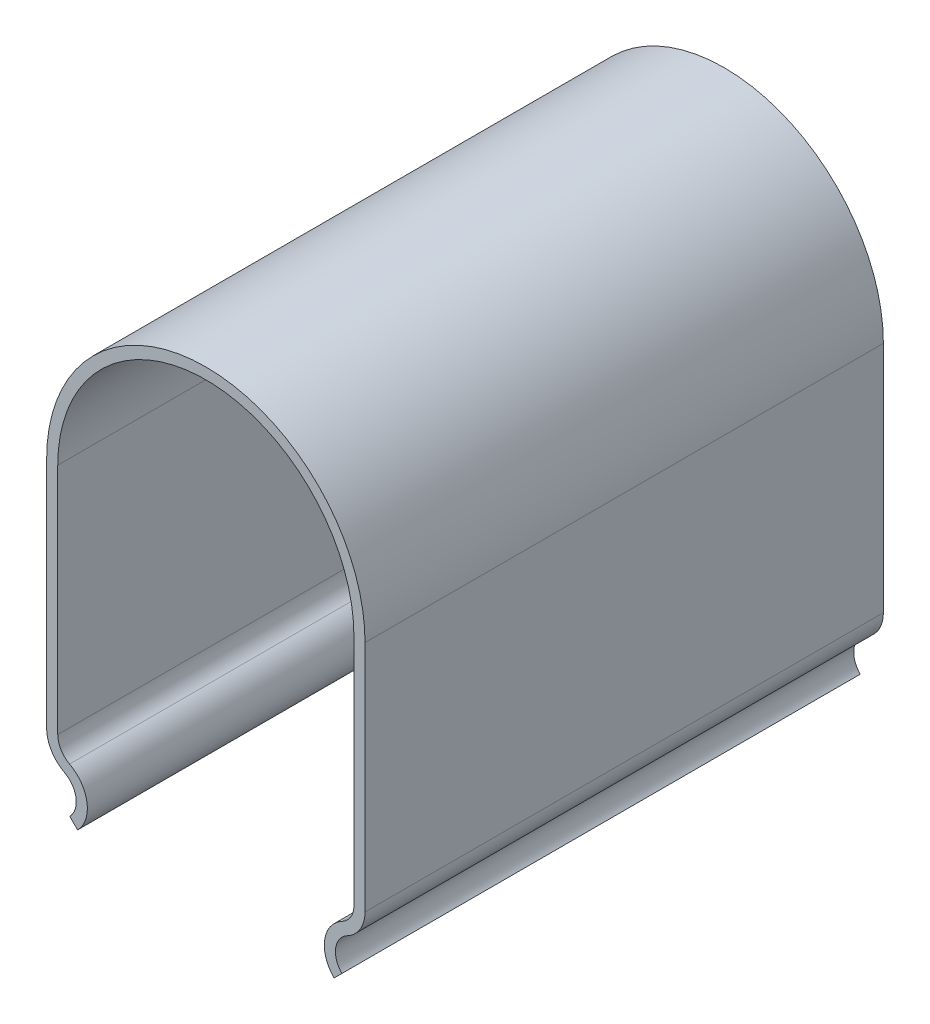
ISO-10303-21;
HEADER;
FILE_DESCRIPTION(('STEP AP214'),'2;1');
FILE_NAME('part.step','',(''),(''),'','','');
FILE_SCHEMA(('AUTOMOTIVE_DESIGN { 1 0 10303 214 1 1 1 1 }'));
ENDSEC;
DATA;
#1=APPLICATION_CONTEXT('core data for automotive mechanical design processes');
#2=APPLICATION_PROTOCOL_DEFINITION('international standard','automotive_design',2000,#1);
#3=PRODUCT_CONTEXT('',#1,'mechanical');
#4=PRODUCT('Part','Part','',(#3));
#5=PRODUCT_RELATED_PRODUCT_CATEGORY('part','',(#4));
#6=PRODUCT_DEFINITION_FORMATION('','',#4);
#7=PRODUCT_DEFINITION_CONTEXT('part definition',#1,'design');
#8=PRODUCT_DEFINITION('design','',#6,#7);
#9=PRODUCT_DEFINITION_SHAPE('','',#8);
#10=(LENGTH_UNIT() NAMED_UNIT(*) SI_UNIT(.MILLI.,.METRE.));
#11=(NAMED_UNIT(*) PLANE_ANGLE_UNIT() SI_UNIT($,.RADIAN.));
#12=(NAMED_UNIT(*) SI_UNIT($,.STERADIAN.) SOLID_ANGLE_UNIT());
#13=UNCERTAINTY_MEASURE_WITH_UNIT(LENGTH_MEASURE(1.E-05),#10,'distance_accuracy_value','');
#14=(GEOMETRIC_REPRESENTATION_CONTEXT(3) GLOBAL_UNCERTAINTY_ASSIGNED_CONTEXT((#13)) GLOBAL_UNIT_ASSIGNED_CONTEXT((#10,
#11,#12)) REPRESENTATION_CONTEXT('',''));
#15=CARTESIAN_POINT('',(0.,0.,0.));
#16=DIRECTION('',(0.,0.,1.));
#17=DIRECTION('',(1.,0.,0.));
#18=AXIS2_PLACEMENT_3D('',#15,#16,#17);
#19=CARTESIAN_POINT('',(17.,-31.5,70.));
#20=DIRECTION('',(0.,0.,-1.));
#21=DIRECTION('',(-1.,0.,0.));
#22=AXIS2_PLACEMENT_3D('',#19,#20,#21);
#23=CYLINDRICAL_SURFACE('',#22,3.);
#24=CARTESIAN_POINT('',(17.,-31.5,0.));
#25=DIRECTION('',(0.,0.,-1.));
#26=DIRECTION('',(1.,0.,0.));
#27=AXIS2_PLACEMENT_3D('',#24,#25,#26);
#28=CIRCLE('',#27,3.);
#29=CARTESIAN_POINT('',(20.,-31.5,0.));
#30=VERTEX_POINT('',#29);
#31=CARTESIAN_POINT('',(18.4,-34.1532998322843,0.));
#32=VERTEX_POINT('',#31);
#33=EDGE_CURVE('E466',#30,#32,#28,.T.);
#34=ORIENTED_EDGE('',*,*,#33,.T.);
#35=DIRECTION('',(0.,0.,-1.));
#36=VECTOR('',#35,1.);
#37=CARTESIAN_POINT('',(18.4,-34.1532998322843,70.));
#38=LINE('',#37,#36);
#39=CARTESIAN_POINT('',(18.4,-34.1532998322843,70.));
#40=VERTEX_POINT('',#39);
#41=EDGE_CURVE('E11',#40,#32,#38,.T.);
#42=ORIENTED_EDGE('',*,*,#41,.F.);
#43=CARTESIAN_POINT('',(17.,-31.5,70.));
#44=DIRECTION('',(0.,0.,-1.));
#45=DIRECTION('',(1.,0.,0.));
#46=AXIS2_PLACEMENT_3D('',#43,#44,#45);
#47=CIRCLE('',#46,3.);
#48=CARTESIAN_POINT('',(20.,-31.5,70.));
#49=VERTEX_POINT('',#48);
#50=EDGE_CURVE('E509',#49,#40,#47,.T.);
#51=ORIENTED_EDGE('',*,*,#50,.F.);
#52=DIRECTION('',(0.,0.,-1.));
#53=VECTOR('',#52,1.);
#54=CARTESIAN_POINT('',(20.,-31.5,70.));
#55=LINE('',#54,#53);
#56=EDGE_CURVE('E479',#49,#30,#55,.T.);
#57=ORIENTED_EDGE('',*,*,#56,.T.);
#58=EDGE_LOOP('',(#34,#42,#51,#57));
#59=FACE_BOUND('',#58,.T.);
#60=ADVANCED_FACE('F350',(#59),#23,.F.);
#61=CARTESIAN_POINT('',(20.5,-38.1332495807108,70.));
#62=DIRECTION('',(0.,0.,-1.));
#63=DIRECTION('',(-1.,0.,0.));
#64=AXIS2_PLACEMENT_3D('',#61,#62,#63);
#65=CYLINDRICAL_SURFACE('',#64,4.5);
#66=CARTESIAN_POINT('',(20.5,-38.1332495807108,0.));
#67=DIRECTION('',(0.,0.,1.));
#68=DIRECTION('',(1.,0.,0.));
#69=AXIS2_PLACEMENT_3D('',#66,#67,#68);
#70=CIRCLE('',#69,4.5);
#71=CARTESIAN_POINT('',(17.3180194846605,-41.3152300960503,0.));
#72=VERTEX_POINT('',#71);
#73=EDGE_CURVE('E462',#32,#72,#70,.T.);
#74=ORIENTED_EDGE('',*,*,#73,.T.);
#75=DIRECTION('',(0.,0.,-1.));
#76=VECTOR('',#75,1.);
#77=CARTESIAN_POINT('',(17.3180194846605,-41.3152300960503,70.));
#78=LINE('',#77,#76);
#79=CARTESIAN_POINT('',(17.3180194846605,-41.3152300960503,70.));
#80=VERTEX_POINT('',#79);
#81=EDGE_CURVE('E357',#80,#72,#78,.T.);
#82=ORIENTED_EDGE('',*,*,#81,.F.);
#83=CARTESIAN_POINT('',(20.5,-38.1332495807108,70.));
#84=DIRECTION('',(0.,0.,1.));
#85=DIRECTION('',(1.,0.,0.));
#86=AXIS2_PLACEMENT_3D('',#83,#84,#85);
#87=CIRCLE('',#86,4.5);
#88=EDGE_CURVE('E475',#40,#80,#87,.T.);
#89=ORIENTED_EDGE('',*,*,#88,.F.);
#90=ORIENTED_EDGE('',*,*,#41,.T.);
#91=EDGE_LOOP('',(#74,#82,#89,#90));
#92=FACE_BOUND('',#91,.T.);
#93=ADVANCED_FACE('F474',(#92),#65,.T.);
#94=CARTESIAN_POINT('',(18.3786796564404,-40.2545699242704,70.));
#95=DIRECTION('',(-0.707106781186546,0.707106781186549,0.));
#96=DIRECTION('',(-0.707106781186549,-0.707106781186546,0.));
#97=AXIS2_PLACEMENT_3D('',#94,#95,#96);
#98=PLANE('',#97);
#99=DIRECTION('',(0.707106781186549,0.707106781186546,0.));
#100=VECTOR('',#99,1.);
#101=CARTESIAN_POINT('',(18.3786796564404,-40.2545699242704,0.));
#102=LINE('',#101,#100);
#103=CARTESIAN_POINT('',(18.3786796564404,-40.2545699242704,0.));
#104=VERTEX_POINT('',#103);
#105=EDGE_CURVE('E468',#72,#104,#102,.T.);
#106=ORIENTED_EDGE('',*,*,#105,.T.);
#107=DIRECTION('',(0.,0.,-1.));
#108=VECTOR('',#107,1.);
#109=CARTESIAN_POINT('',(18.3786796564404,-40.2545699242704,70.));
#110=LINE('',#109,#108);
#111=CARTESIAN_POINT('',(18.3786796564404,-40.2545699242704,70.));
#112=VERTEX_POINT('',#111);
#113=EDGE_CURVE('E575',#112,#104,#110,.T.);
#114=ORIENTED_EDGE('',*,*,#113,.F.);
#115=DIRECTION('',(0.707106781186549,0.707106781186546,0.));
#116=VECTOR('',#115,1.);
#117=CARTESIAN_POINT('',(18.3786796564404,-40.2545699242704,70.));
#118=LINE('',#117,#116);
#119=EDGE_CURVE('E512',#80,#112,#118,.T.);
#120=ORIENTED_EDGE('',*,*,#119,.F.);
#121=ORIENTED_EDGE('',*,*,#81,.T.);
#122=EDGE_LOOP('',(#106,#114,#120,#121));
#123=FACE_BOUND('',#122,.T.);
#124=ADVANCED_FACE('F579',(#123),#98,.F.);
#125=CARTESIAN_POINT('',(20.5,-38.1332495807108,70.));
#126=DIRECTION('',(0.,0.,-1.));
#127=DIRECTION('',(-1.,0.,0.));
#128=AXIS2_PLACEMENT_3D('',#125,#126,#127);
#129=CYLINDRICAL_SURFACE('',#128,3.);
#130=CARTESIAN_POINT('',(20.5,-38.1332495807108,0.));
#131=DIRECTION('',(0.,0.,-1.));
#132=DIRECTION('',(1.,0.,0.));
#133=AXIS2_PLACEMENT_3D('',#130,#131,#132);
#134=CIRCLE('',#133,3.);
#135=CARTESIAN_POINT('',(19.1,-35.4799497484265,0.));
#136=VERTEX_POINT('',#135);
#137=EDGE_CURVE('E483',#104,#136,#134,.T.);
#138=ORIENTED_EDGE('',*,*,#137,.T.);
#139=DIRECTION('',(0.,0.,-1.));
#140=VECTOR('',#139,1.);
#141=CARTESIAN_POINT('',(19.1,-35.4799497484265,70.));
#142=LINE('',#141,#140);
#143=CARTESIAN_POINT('',(19.1,-35.4799497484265,70.));
#144=VERTEX_POINT('',#143);
#145=EDGE_CURVE('E572',#144,#136,#142,.T.);
#146=ORIENTED_EDGE('',*,*,#145,.F.);
#147=CARTESIAN_POINT('',(20.5,-38.1332495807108,70.));
#148=DIRECTION('',(0.,0.,-1.));
#149=DIRECTION('',(1.,0.,0.));
#150=AXIS2_PLACEMENT_3D('',#147,#148,#149);
#151=CIRCLE('',#150,3.);
#152=EDGE_CURVE('E514',#112,#144,#151,.T.);
#153=ORIENTED_EDGE('',*,*,#152,.F.);
#154=ORIENTED_EDGE('',*,*,#113,.T.);
#155=EDGE_LOOP('',(#138,#146,#153,#154));
#156=FACE_BOUND('',#155,.T.);
#157=ADVANCED_FACE('F587',(#156),#129,.F.);
#158=CARTESIAN_POINT('',(17.,-31.5,70.));
#159=DIRECTION('',(0.,0.,-1.));
#160=DIRECTION('',(-1.,0.,0.));
#161=AXIS2_PLACEMENT_3D('',#158,#159,#160);
#162=CYLINDRICAL_SURFACE('',#161,4.5);
#163=CARTESIAN_POINT('',(17.,-31.5,0.));
#164=DIRECTION('',(0.,0.,1.));
#165=DIRECTION('',(1.,0.,0.));
#166=AXIS2_PLACEMENT_3D('',#163,#164,#165);
#167=CIRCLE('',#166,4.5);
#168=CARTESIAN_POINT('',(21.5,-31.5,0.));
#169=VERTEX_POINT('',#168);
#170=EDGE_CURVE('E485',#136,#169,#167,.T.);
#171=ORIENTED_EDGE('',*,*,#170,.T.);
#172=DIRECTION('',(0.,0.,-1.));
#173=VECTOR('',#172,1.);
#174=CARTESIAN_POINT('',(21.5,-31.5,70.));
#175=LINE('',#174,#173);
#176=CARTESIAN_POINT('',(21.5,-31.5,70.));
#177=VERTEX_POINT('',#176);
#178=EDGE_CURVE('E569',#177,#169,#175,.T.);
#179=ORIENTED_EDGE('',*,*,#178,.F.);
#180=CARTESIAN_POINT('',(17.,-31.5,70.));
#181=DIRECTION('',(0.,0.,1.));
#182=DIRECTION('',(1.,0.,0.));
#183=AXIS2_PLACEMENT_3D('',#180,#181,#182);
#184=CIRCLE('',#183,4.5);
#185=EDGE_CURVE('E516',#144,#177,#184,.T.);
#186=ORIENTED_EDGE('',*,*,#185,.F.);
#187=ORIENTED_EDGE('',*,*,#145,.T.);
#188=EDGE_LOOP('',(#171,#179,#186,#187));
#189=FACE_BOUND('',#188,.T.);
#190=ADVANCED_FACE('F590',(#189),#162,.T.);
#191=CARTESIAN_POINT('',(21.5,0.,70.));
#192=DIRECTION('',(-1.,0.,0.));
#193=DIRECTION('',(0.,-1.,0.));
#194=AXIS2_PLACEMENT_3D('',#191,#192,#193);
#195=PLANE('',#194);
#196=DIRECTION('',(0.,1.,0.));
#197=VECTOR('',#196,1.);
#198=CARTESIAN_POINT('',(21.5,0.,0.));
#199=LINE('',#198,#197);
#200=CARTESIAN_POINT('',(21.5,0.,0.));
#201=VERTEX_POINT('',#200);
#202=EDGE_CURVE('E487',#169,#201,#199,.T.);
#203=ORIENTED_EDGE('',*,*,#202,.T.);
#204=DIRECTION('',(0.,0.,-1.));
#205=VECTOR('',#204,1.);
#206=CARTESIAN_POINT('',(21.5,0.,70.));
#207=LINE('',#206,#205);
#208=CARTESIAN_POINT('',(21.5,0.,70.));
#209=VERTEX_POINT('',#208);
#210=EDGE_CURVE('E566',#209,#201,#207,.T.);
#211=ORIENTED_EDGE('',*,*,#210,.F.);
#212=DIRECTION('',(0.,1.,0.));
#213=VECTOR('',#212,1.);
#214=CARTESIAN_POINT('',(21.5,0.,70.));
#215=LINE('',#214,#213);
#216=EDGE_CURVE('E518',#177,#209,#215,.T.);
#217=ORIENTED_EDGE('',*,*,#216,.F.);
#218=ORIENTED_EDGE('',*,*,#178,.T.);
#219=EDGE_LOOP('',(#203,#211,#217,#218));
#220=FACE_BOUND('',#219,.T.);
#221=ADVANCED_FACE('F595',(#220),#195,.F.);
#222=CARTESIAN_POINT('',(0.,0.,70.));
#223=DIRECTION('',(0.,0.,-1.));
#224=DIRECTION('',(-1.,0.,0.));
#225=AXIS2_PLACEMENT_3D('',#222,#223,#224);
#226=CYLINDRICAL_SURFACE('',#225,21.5);
#227=CARTESIAN_POINT('',(0.,0.,0.));
#228=DIRECTION('',(0.,0.,1.));
#229=DIRECTION('',(1.,0.,0.));
#230=AXIS2_PLACEMENT_3D('',#227,#228,#229);
#231=CIRCLE('',#230,21.5);
#232=CARTESIAN_POINT('',(-21.5,0.,0.));
#233=VERTEX_POINT('',#232);
#234=EDGE_CURVE('E489',#201,#233,#231,.T.);
#235=ORIENTED_EDGE('',*,*,#234,.T.);
#236=DIRECTION('',(0.,0.,-1.));
#237=VECTOR('',#236,1.);
#238=CARTESIAN_POINT('',(-21.5,0.,70.));
#239=LINE('',#238,#237);
#240=CARTESIAN_POINT('',(-21.5,0.,70.));
#241=VERTEX_POINT('',#240);
#242=EDGE_CURVE('E563',#241,#233,#239,.T.);
#243=ORIENTED_EDGE('',*,*,#242,.F.);
#244=CARTESIAN_POINT('',(0.,0.,70.));
#245=DIRECTION('',(0.,0.,1.));
#246=DIRECTION('',(1.,0.,0.));
#247=AXIS2_PLACEMENT_3D('',#244,#245,#246);
#248=CIRCLE('',#247,21.5);
#249=EDGE_CURVE('E520',#209,#241,#248,.T.);
#250=ORIENTED_EDGE('',*,*,#249,.F.);
#251=ORIENTED_EDGE('',*,*,#210,.T.);
#252=EDGE_LOOP('',(#235,#243,#250,#251));
#253=FACE_BOUND('',#252,.T.);
#254=ADVANCED_FACE('F601',(#253),#226,.T.);
#255=CARTESIAN_POINT('',(-21.5,-31.5,70.));
#256=DIRECTION('',(1.,0.,0.));
#257=DIRECTION('',(0.,0.,-1.));
#258=AXIS2_PLACEMENT_3D('',#255,#256,#257);
#259=PLANE('',#258);
#260=DIRECTION('',(0.,-1.,0.));
#261=VECTOR('',#260,1.);
#262=CARTESIAN_POINT('',(-21.5,-31.5,0.));
#263=LINE('',#262,#261);
#264=CARTESIAN_POINT('',(-21.5,-31.5,0.));
#265=VERTEX_POINT('',#264);
#266=EDGE_CURVE('E491',#233,#265,#263,.T.);
#267=ORIENTED_EDGE('',*,*,#266,.T.);
#268=DIRECTION('',(0.,0.,-1.));
#269=VECTOR('',#268,1.);
#270=CARTESIAN_POINT('',(-21.5,-31.5,70.));
#271=LINE('',#270,#269);
#272=CARTESIAN_POINT('',(-21.5,-31.5,70.));
#273=VERTEX_POINT('',#272);
#274=EDGE_CURVE('E560',#273,#265,#271,.T.);
#275=ORIENTED_EDGE('',*,*,#274,.F.);
#276=DIRECTION('',(0.,-1.,0.));
#277=VECTOR('',#276,1.);
#278=CARTESIAN_POINT('',(-21.5,-31.5,70.));
#279=LINE('',#278,#277);
#280=EDGE_CURVE('E522',#241,#273,#279,.T.);
#281=ORIENTED_EDGE('',*,*,#280,.F.);
#282=ORIENTED_EDGE('',*,*,#242,.T.);
#283=EDGE_LOOP('',(#267,#275,#281,#282));
#284=FACE_BOUND('',#283,.T.);
#285=ADVANCED_FACE('F605',(#284),#259,.F.);
#286=CARTESIAN_POINT('',(-17.,-31.5,70.));
#287=DIRECTION('',(0.,0.,-1.));
#288=DIRECTION('',(-1.,0.,0.));
#289=AXIS2_PLACEMENT_3D('',#286,#287,#288);
#290=CYLINDRICAL_SURFACE('',#289,4.5);
#291=CARTESIAN_POINT('',(-17.,-31.5,0.));
#292=DIRECTION('',(0.,0.,1.));
#293=DIRECTION('',(-1.,0.,0.));
#294=AXIS2_PLACEMENT_3D('',#291,#292,#293);
#295=CIRCLE('',#294,4.5);
#296=CARTESIAN_POINT('',(-19.1,-35.4799497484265,0.));
#297=VERTEX_POINT('',#296);
#298=EDGE_CURVE('E493',#265,#297,#295,.T.);
#299=ORIENTED_EDGE('',*,*,#298,.T.);
#300=DIRECTION('',(0.,0.,-1.));
#301=VECTOR('',#300,1.);
#302=CARTESIAN_POINT('',(-19.1,-35.4799497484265,70.));
#303=LINE('',#302,#301);
#304=CARTESIAN_POINT('',(-19.1,-35.4799497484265,70.));
#305=VERTEX_POINT('',#304);
#306=EDGE_CURVE('E557',#305,#297,#303,.T.);
#307=ORIENTED_EDGE('',*,*,#306,.F.);
#308=CARTESIAN_POINT('',(-17.,-31.5,70.));
#309=DIRECTION('',(0.,0.,1.));
#310=DIRECTION('',(-1.,0.,0.));
#311=AXIS2_PLACEMENT_3D('',#308,#309,#310);
#312=CIRCLE('',#311,4.5);
#313=EDGE_CURVE('E524',#273,#305,#312,.T.);
#314=ORIENTED_EDGE('',*,*,#313,.F.);
#315=ORIENTED_EDGE('',*,*,#274,.T.);
#316=EDGE_LOOP('',(#299,#307,#314,#315));
#317=FACE_BOUND('',#316,.T.);
#318=ADVANCED_FACE('F610',(#317),#290,.T.);
#319=CARTESIAN_POINT('',(-20.5,-38.1332495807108,70.));
#320=DIRECTION('',(0.,0.,-1.));
#321=DIRECTION('',(-1.,0.,0.));
#322=AXIS2_PLACEMENT_3D('',#319,#320,#321);
#323=CYLINDRICAL_SURFACE('',#322,3.);
#324=CARTESIAN_POINT('',(-20.5,-38.1332495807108,0.));
#325=DIRECTION('',(0.,0.,-1.));
#326=DIRECTION('',(-1.,0.,0.));
#327=AXIS2_PLACEMENT_3D('',#324,#325,#326);
#328=CIRCLE('',#327,3.);
#329=CARTESIAN_POINT('',(-18.3786796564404,-40.2545699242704,0.));
#330=VERTEX_POINT('',#329);
#331=EDGE_CURVE('E495',#297,#330,#328,.T.);
#332=ORIENTED_EDGE('',*,*,#331,.T.);
#333=DIRECTION('',(0.,0.,-1.));
#334=VECTOR('',#333,1.);
#335=CARTESIAN_POINT('',(-18.3786796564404,-40.2545699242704,70.));
#336=LINE('',#335,#334);
#337=CARTESIAN_POINT('',(-18.3786796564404,-40.2545699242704,70.));
#338=VERTEX_POINT('',#337);
#339=EDGE_CURVE('E554',#338,#330,#336,.T.);
#340=ORIENTED_EDGE('',*,*,#339,.F.);
#341=CARTESIAN_POINT('',(-20.5,-38.1332495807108,70.));
#342=DIRECTION('',(0.,0.,-1.));
#343=DIRECTION('',(-1.,0.,0.));
#344=AXIS2_PLACEMENT_3D('',#341,#342,#343);
#345=CIRCLE('',#344,3.);
#346=EDGE_CURVE('E526',#305,#338,#345,.T.);
#347=ORIENTED_EDGE('',*,*,#346,.F.);
#348=ORIENTED_EDGE('',*,*,#306,.T.);
#349=EDGE_LOOP('',(#332,#340,#347,#348));
#350=FACE_BOUND('',#349,.T.);
#351=ADVANCED_FACE('F616',(#350),#323,.F.);
#352=CARTESIAN_POINT('',(-18.3786796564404,-40.2545699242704,70.));
#353=DIRECTION('',(0.707106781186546,0.707106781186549,0.));
#354=DIRECTION('',(-0.707106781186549,0.707106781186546,0.));
#355=AXIS2_PLACEMENT_3D('',#352,#353,#354);
#356=PLANE('',#355);
#357=DIRECTION('',(0.707106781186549,-0.707106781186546,0.));
#358=VECTOR('',#357,1.);
#359=CARTESIAN_POINT('',(-18.3786796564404,-40.2545699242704,0.));
#360=LINE('',#359,#358);
#361=CARTESIAN_POINT('',(-17.3180194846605,-41.3152300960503,0.));
#362=VERTEX_POINT('',#361);
#363=EDGE_CURVE('E497',#330,#362,#360,.T.);
#364=ORIENTED_EDGE('',*,*,#363,.T.);
#365=DIRECTION('',(0.,0.,-1.));
#366=VECTOR('',#365,1.);
#367=CARTESIAN_POINT('',(-17.3180194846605,-41.3152300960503,70.));
#368=LINE('',#367,#366);
#369=CARTESIAN_POINT('',(-17.3180194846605,-41.3152300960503,70.));
#370=VERTEX_POINT('',#369);
#371=EDGE_CURVE('E551',#370,#362,#368,.T.);
#372=ORIENTED_EDGE('',*,*,#371,.F.);
#373=DIRECTION('',(0.707106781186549,-0.707106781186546,0.));
#374=VECTOR('',#373,1.);
#375=CARTESIAN_POINT('',(-18.3786796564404,-40.2545699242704,70.));
#376=LINE('',#375,#374);
#377=EDGE_CURVE('E528',#338,#370,#376,.T.);
#378=ORIENTED_EDGE('',*,*,#377,.F.);
#379=ORIENTED_EDGE('',*,*,#339,.T.);
#380=EDGE_LOOP('',(#364,#372,#378,#379));
#381=FACE_BOUND('',#380,.T.);
#382=ADVANCED_FACE('F620',(#381),#356,.F.);
#383=CARTESIAN_POINT('',(-20.5,-38.1332495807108,70.));
#384=DIRECTION('',(0.,0.,-1.));
#385=DIRECTION('',(-1.,0.,0.));
#386=AXIS2_PLACEMENT_3D('',#383,#384,#385);
#387=CYLINDRICAL_SURFACE('',#386,4.5);
#388=CARTESIAN_POINT('',(-20.5,-38.1332495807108,0.));
#389=DIRECTION('',(0.,0.,1.));
#390=DIRECTION('',(-1.,0.,0.));
#391=AXIS2_PLACEMENT_3D('',#388,#389,#390);
#392=CIRCLE('',#391,4.5);
#393=CARTESIAN_POINT('',(-18.4,-34.1532998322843,0.));
#394=VERTEX_POINT('',#393);
#395=EDGE_CURVE('E499',#362,#394,#392,.T.);
#396=ORIENTED_EDGE('',*,*,#395,.T.);
#397=DIRECTION('',(0.,0.,-1.));
#398=VECTOR('',#397,1.);
#399=CARTESIAN_POINT('',(-18.4,-34.1532998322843,70.));
#400=LINE('',#399,#398);
#401=CARTESIAN_POINT('',(-18.4,-34.1532998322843,70.));
#402=VERTEX_POINT('',#401);
#403=EDGE_CURVE('E548',#402,#394,#400,.T.);
#404=ORIENTED_EDGE('',*,*,#403,.F.);
#405=CARTESIAN_POINT('',(-20.5,-38.1332495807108,70.));
#406=DIRECTION('',(0.,0.,1.));
#407=DIRECTION('',(-1.,0.,0.));
#408=AXIS2_PLACEMENT_3D('',#405,#406,#407);
#409=CIRCLE('',#408,4.5);
#410=EDGE_CURVE('E530',#370,#402,#409,.T.);
#411=ORIENTED_EDGE('',*,*,#410,.F.);
#412=ORIENTED_EDGE('',*,*,#371,.T.);
#413=EDGE_LOOP('',(#396,#404,#411,#412));
#414=FACE_BOUND('',#413,.T.);
#415=ADVANCED_FACE('F625',(#414),#387,.T.);
#416=CARTESIAN_POINT('',(-17.,-31.5,70.));
#417=DIRECTION('',(0.,0.,-1.));
#418=DIRECTION('',(-1.,0.,0.));
#419=AXIS2_PLACEMENT_3D('',#416,#417,#418);
#420=CYLINDRICAL_SURFACE('',#419,3.);
#421=CARTESIAN_POINT('',(-17.,-31.5,0.));
#422=DIRECTION('',(0.,0.,-1.));
#423=DIRECTION('',(-1.,0.,0.));
#424=AXIS2_PLACEMENT_3D('',#421,#422,#423);
#425=CIRCLE('',#424,3.);
#426=CARTESIAN_POINT('',(-20.,-31.5,0.));
#427=VERTEX_POINT('',#426);
#428=EDGE_CURVE('E501',#394,#427,#425,.T.);
#429=ORIENTED_EDGE('',*,*,#428,.T.);
#430=DIRECTION('',(0.,0.,-1.));
#431=VECTOR('',#430,1.);
#432=CARTESIAN_POINT('',(-20.,-31.5,70.));
#433=LINE('',#432,#431);
#434=CARTESIAN_POINT('',(-20.,-31.5,70.));
#435=VERTEX_POINT('',#434);
#436=EDGE_CURVE('E545',#435,#427,#433,.T.);
#437=ORIENTED_EDGE('',*,*,#436,.F.);
#438=CARTESIAN_POINT('',(-17.,-31.5,70.));
#439=DIRECTION('',(0.,0.,-1.));
#440=DIRECTION('',(-1.,0.,0.));
#441=AXIS2_PLACEMENT_3D('',#438,#439,#440);
#442=CIRCLE('',#441,3.);
#443=EDGE_CURVE('E532',#402,#435,#442,.T.);
#444=ORIENTED_EDGE('',*,*,#443,.F.);
#445=ORIENTED_EDGE('',*,*,#403,.T.);
#446=EDGE_LOOP('',(#429,#437,#444,#445));
#447=FACE_BOUND('',#446,.T.);
#448=ADVANCED_FACE('F631',(#447),#420,.F.);
#449=CARTESIAN_POINT('',(-20.,0.,70.));
#450=DIRECTION('',(-1.,0.,0.));
#451=DIRECTION('',(0.,-1.,0.));
#452=AXIS2_PLACEMENT_3D('',#449,#450,#451);
#453=PLANE('',#452);
#454=DIRECTION('',(0.,1.,0.));
#455=VECTOR('',#454,1.);
#456=CARTESIAN_POINT('',(-20.,0.,0.));
#457=LINE('',#456,#455);
#458=CARTESIAN_POINT('',(-20.,0.,0.));
#459=VERTEX_POINT('',#458);
#460=EDGE_CURVE('E503',#427,#459,#457,.T.);
#461=ORIENTED_EDGE('',*,*,#460,.T.);
#462=DIRECTION('',(0.,0.,-1.));
#463=VECTOR('',#462,1.);
#464=CARTESIAN_POINT('',(-20.,0.,70.));
#465=LINE('',#464,#463);
#466=CARTESIAN_POINT('',(-20.,0.,70.));
#467=VERTEX_POINT('',#466);
#468=EDGE_CURVE('E542',#467,#459,#465,.T.);
#469=ORIENTED_EDGE('',*,*,#468,.F.);
#470=DIRECTION('',(0.,1.,0.));
#471=VECTOR('',#470,1.);
#472=CARTESIAN_POINT('',(-20.,0.,70.));
#473=LINE('',#472,#471);
#474=EDGE_CURVE('E534',#435,#467,#473,.T.);
#475=ORIENTED_EDGE('',*,*,#474,.F.);
#476=ORIENTED_EDGE('',*,*,#436,.T.);
#477=EDGE_LOOP('',(#461,#469,#475,#476));
#478=FACE_BOUND('',#477,.T.);
#479=ADVANCED_FACE('F635',(#478),#453,.F.);
#480=CARTESIAN_POINT('',(0.,0.,70.));
#481=DIRECTION('',(0.,0.,-1.));
#482=DIRECTION('',(-1.,0.,0.));
#483=AXIS2_PLACEMENT_3D('',#480,#481,#482);
#484=CYLINDRICAL_SURFACE('',#483,20.);
#485=CARTESIAN_POINT('',(0.,0.,0.));
#486=DIRECTION('',(0.,0.,-1.));
#487=DIRECTION('',(1.,0.,0.));
#488=AXIS2_PLACEMENT_3D('',#485,#486,#487);
#489=CIRCLE('',#488,20.);
#490=CARTESIAN_POINT('',(20.,0.,0.));
#491=VERTEX_POINT('',#490);
#492=EDGE_CURVE('E505',#459,#491,#489,.T.);
#493=ORIENTED_EDGE('',*,*,#492,.T.);
#494=DIRECTION('',(0.,0.,-1.));
#495=VECTOR('',#494,1.);
#496=CARTESIAN_POINT('',(20.,0.,70.));
#497=LINE('',#496,#495);
#498=CARTESIAN_POINT('',(20.,0.,70.));
#499=VERTEX_POINT('',#498);
#500=EDGE_CURVE('E539',#499,#491,#497,.T.);
#501=ORIENTED_EDGE('',*,*,#500,.F.);
#502=CARTESIAN_POINT('',(0.,0.,70.));
#503=DIRECTION('',(0.,0.,-1.));
#504=DIRECTION('',(1.,0.,0.));
#505=AXIS2_PLACEMENT_3D('',#502,#503,#504);
#506=CIRCLE('',#505,20.);
#507=EDGE_CURVE('E369',#467,#499,#506,.T.);
#508=ORIENTED_EDGE('',*,*,#507,.F.);
#509=ORIENTED_EDGE('',*,*,#468,.T.);
#510=EDGE_LOOP('',(#493,#501,#508,#509));
#511=FACE_BOUND('',#510,.T.);
#512=ADVANCED_FACE('F638',(#511),#484,.F.);
#513=CARTESIAN_POINT('',(20.,0.,70.));
#514=DIRECTION('',(1.,0.,0.));
#515=DIRECTION('',(0.,1.,0.));
#516=AXIS2_PLACEMENT_3D('',#513,#514,#515);
#517=PLANE('',#516);
#518=DIRECTION('',(0.,-1.,0.));
#519=VECTOR('',#518,1.);
#520=CARTESIAN_POINT('',(20.,0.,0.));
#521=LINE('',#520,#519);
#522=EDGE_CURVE('E507',#491,#30,#521,.T.);
#523=ORIENTED_EDGE('',*,*,#522,.T.);
#524=ORIENTED_EDGE('',*,*,#56,.F.);
#525=DIRECTION('',(0.,-1.,0.));
#526=VECTOR('',#525,1.);
#527=CARTESIAN_POINT('',(20.,0.,70.));
#528=LINE('',#527,#526);
#529=EDGE_CURVE('E364',#499,#49,#528,.T.);
#530=ORIENTED_EDGE('',*,*,#529,.F.);
#531=ORIENTED_EDGE('',*,*,#500,.T.);
#532=EDGE_LOOP('',(#523,#524,#530,#531));
#533=FACE_BOUND('',#532,.T.);
#534=ADVANCED_FACE('F640',(#533),#517,.F.);
#535=CARTESIAN_POINT('',(17.,-31.5,70.));
#536=DIRECTION('',(0.,0.,1.));
#537=DIRECTION('',(1.,0.,0.));
#538=AXIS2_PLACEMENT_3D('',#535,#536,#537);
#539=PLANE('',#538);
#540=ORIENTED_EDGE('',*,*,#50,.T.);
#541=ORIENTED_EDGE('',*,*,#88,.T.);
#542=ORIENTED_EDGE('',*,*,#119,.T.);
#543=ORIENTED_EDGE('',*,*,#152,.T.);
#544=ORIENTED_EDGE('',*,*,#185,.T.);
#545=ORIENTED_EDGE('',*,*,#216,.T.);
#546=ORIENTED_EDGE('',*,*,#249,.T.);
#547=ORIENTED_EDGE('',*,*,#280,.T.);
#548=ORIENTED_EDGE('',*,*,#313,.T.);
#549=ORIENTED_EDGE('',*,*,#346,.T.);
#550=ORIENTED_EDGE('',*,*,#377,.T.);
#551=ORIENTED_EDGE('',*,*,#410,.T.);
#552=ORIENTED_EDGE('',*,*,#443,.T.);
#553=ORIENTED_EDGE('',*,*,#474,.T.);
#554=ORIENTED_EDGE('',*,*,#507,.T.);
#555=ORIENTED_EDGE('',*,*,#529,.T.);
#556=EDGE_LOOP('',(#540,#541,#542,#543,#544,#545,#546,#547,#548,#549,#550,#551,#552,#553,#554,#555));
#557=FACE_BOUND('',#556,.T.);
#558=ADVANCED_FACE('F582',(#557),#539,.T.);
#559=CARTESIAN_POINT('',(17.,-31.5,0.));
#560=DIRECTION('',(0.,0.,1.));
#561=DIRECTION('',(1.,0.,0.));
#562=AXIS2_PLACEMENT_3D('',#559,#560,#561);
#563=PLANE('',#562);
#564=ORIENTED_EDGE('',*,*,#33,.F.);
#565=ORIENTED_EDGE('',*,*,#522,.F.);
#566=ORIENTED_EDGE('',*,*,#492,.F.);
#567=ORIENTED_EDGE('',*,*,#460,.F.);
#568=ORIENTED_EDGE('',*,*,#428,.F.);
#569=ORIENTED_EDGE('',*,*,#395,.F.);
#570=ORIENTED_EDGE('',*,*,#363,.F.);
#571=ORIENTED_EDGE('',*,*,#331,.F.);
#572=ORIENTED_EDGE('',*,*,#298,.F.);
#573=ORIENTED_EDGE('',*,*,#266,.F.);
#574=ORIENTED_EDGE('',*,*,#234,.F.);
#575=ORIENTED_EDGE('',*,*,#202,.F.);
#576=ORIENTED_EDGE('',*,*,#170,.F.);
#577=ORIENTED_EDGE('',*,*,#137,.F.);
#578=ORIENTED_EDGE('',*,*,#105,.F.);
#579=ORIENTED_EDGE('',*,*,#73,.F.);
#580=EDGE_LOOP('',(#564,#565,#566,#567,#568,#569,#570,#571,#572,#573,#574,#575,#576,#577,#578,#579));
#581=FACE_BOUND('',#580,.T.);
#582=ADVANCED_FACE('F463',(#581),#563,.F.);
#583=CLOSED_SHELL('',(#60,#93,#124,#157,#190,#221,#254,#285,#318,#351,#382,#415,#448,#479,#512,
#534,#558,#582));
#584=MANIFOLD_SOLID_BREP('B2',#583);
#585=ADVANCED_BREP_SHAPE_REPRESENTATION('',(#18,#584),#14);
#586=SHAPE_DEFINITION_REPRESENTATION(#9,#585);
ENDSEC;
END-ISO-10303-21;
